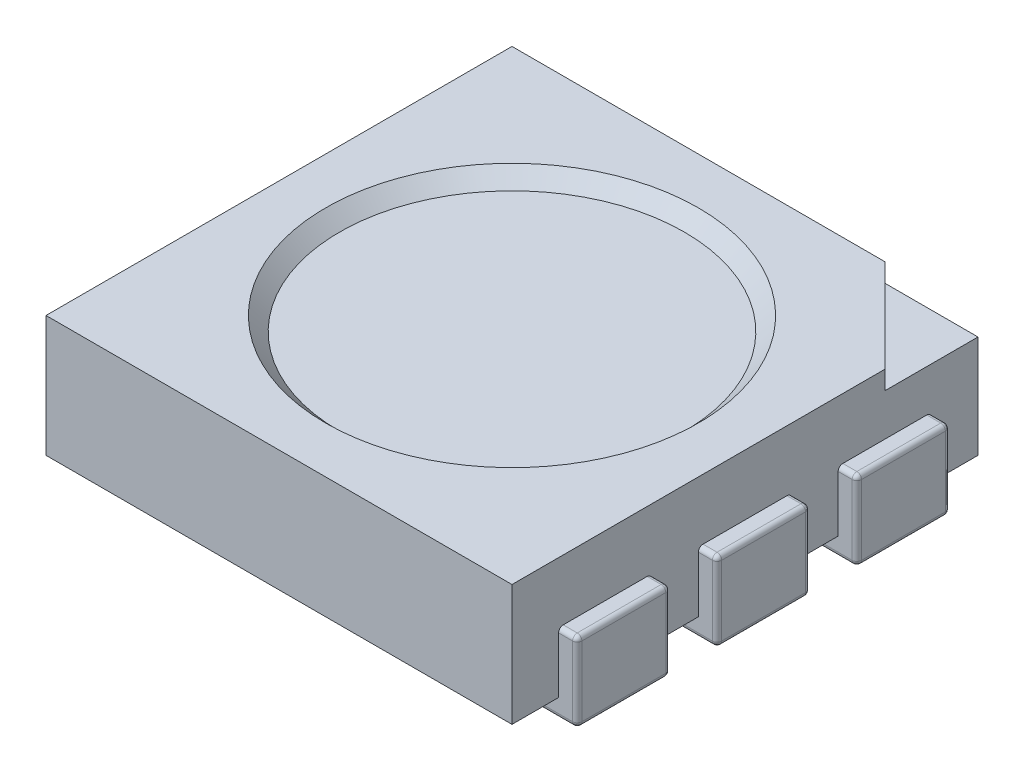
from build123d import *

# Parameters (mm, degrees)
SKETCH1_W                = 5
SKETCH1_H                = 5
BOSS_EXTRUDE1_DEPTH      = 1.3
CUT_EXTRUDE1_DEPTH       = 0.2
SKETCH3_R                = 2
CUT_EXTRUDE2_DEPTH       = 0.65
CUT_EXTRUDE2_DRAFT       = -45
BOSS_EXTRUDE2_DEPTH      = 0.2
BOSS_EXTRUDE2_DEPTH_BACK = 0.65
SKETCH4_W                = 1.4
SKETCH4_H                = 1
SKETCH5_R                = 0.5
SKETCH5_W                = 1
SKETCH5_H                = 1.5
CUT_EXTRUDE3_DEPTH       = 0.1
SKETCH6_R                = 0.25
CUT_EXTRUDE4_DEPTH       = 0.1
SKETCH7_R                = 1.35
BOSS_EXTRUDE3_DEPTH      = 0.5
BOSS_EXTRUDE3_DRAFT      = -45
FILLET2_R                = 0.05


with BuildPart() as part:
    # Sketch1 → Boss-Extrude1 (new body)
    with BuildSketch(Plane(origin=(0, 0, 0), x_dir=(1, 0, 0), z_dir=(0, 1, 0))):
        with Locations((2.5, 2.5)):
            Rectangle(SKETCH1_W, SKETCH1_H)
    extrude(amount=BOSS_EXTRUDE1_DEPTH)

    # Sketch2 → Cut-Extrude1 (cut)
    with BuildSketch(Plane(origin=(0, 1.3, 0), x_dir=(1, 0, 0), z_dir=(0, 1, 0))):
        Polygon((5, 5), (4, 5), (5, 4), align=None)
    extrude(amount=-CUT_EXTRUDE1_DEPTH, mode=Mode.SUBTRACT)


with BuildPart() as cut_extrude2_tool:
    # Sketch3 → Cut-Extrude2 (with draft: the straight prism first)
    with BuildSketch(Plane(origin=(0, 1.3, 0), x_dir=(1, 0, 0), z_dir=(0, 1, 0))):
        with Locations((2.5, 2.5)):
            Circle(SKETCH3_R)
    extrude(amount=-CUT_EXTRUDE2_DEPTH)
    # Cut-Extrude2: the draft: its side faces are tilted about the plane it starts from
    cut_extrude2_sides = [cut_extrude2_tool.faces().sort_by_distance(p)[0] for p in [
        (0.5, 0.975, -2.5),
    ]]
    draft(cut_extrude2_sides, Plane(origin=(0, 1.3, 0), x_dir=(1, 0, 0), z_dir=(0, 1, 0)), CUT_EXTRUDE2_DRAFT)


with BuildPart() as part_1:
    add(part.part)

    # Cut-Extrude2: cut by cut_extrude2_tool
    add(cut_extrude2_tool.part, mode=Mode.SUBTRACT)

    # Sketch4 → Boss-Extrude2 (add, two sides: drawn at the far end of the back side and taken through both)
    with BuildSketch(Plane.XZ.offset(-BOSS_EXTRUDE2_DEPTH_BACK)):
        with Locations((0.5, -2.5)):
            Rectangle(SKETCH4_W, SKETCH4_H)
        with Locations((0.5, -1)):
            Rectangle(SKETCH4_W, SKETCH4_H)
        with Locations((0.5, -4)):
            Rectangle(SKETCH4_W, SKETCH4_H)
        with Locations((4.5, -4)):
            Rectangle(SKETCH4_W, SKETCH4_H)
        with Locations((4.5, -2.5)):
            Rectangle(SKETCH4_W, SKETCH4_H)
        with Locations((4.5, -1)):
            Rectangle(SKETCH4_W, SKETCH4_H)
    extrude(amount=BOSS_EXTRUDE2_DEPTH + BOSS_EXTRUDE2_DEPTH_BACK)

    # Sketch5 → Cut-Extrude3 (cut)
    with BuildSketch(Plane.XZ):
        with Locations(Location((2.5, -2.5, 0), (0, 0, 270))):
            Circle(SKETCH5_R)
        with Locations((2.5, -3.85)):
            Rectangle(SKETCH5_W, SKETCH5_H)
        with Locations((2.5, -1.15)):
            Rectangle(SKETCH5_W, SKETCH5_H)
    extrude(amount=-CUT_EXTRUDE3_DEPTH, mode=Mode.SUBTRACT)

    # Sketch6 → Cut-Extrude4 (cut)
    with BuildSketch(Plane.XZ.offset(-0.1)):
        with Locations(Location((2.5, -2.5, 0), (0, 0, 270))):
            Circle(SKETCH6_R)
    extrude(amount=-CUT_EXTRUDE4_DEPTH, mode=Mode.SUBTRACT)


with BuildPart() as boss_extrude3_tool:
    # Sketch7 → Boss-Extrude3 (with draft: the straight prism first)
    with BuildSketch(Plane(origin=(0, 0.65, 0), x_dir=(1, 0, 0), z_dir=(0, 1, 0))):
        with Locations((2.5, 2.5)):
            Circle(SKETCH7_R)
    extrude(amount=BOSS_EXTRUDE3_DEPTH)
    # Boss-Extrude3: the draft: its side faces are tilted about the plane it starts from
    boss_extrude3_sides = [boss_extrude3_tool.faces().sort_by_distance(p)[0] for p in [
        (1.15, 0.9, -2.5),
    ]]
    draft(boss_extrude3_sides, Plane(origin=(0, 0.65, 0), x_dir=(1, 0, 0), z_dir=(0, 1, 0)), BOSS_EXTRUDE3_DRAFT)


with BuildPart() as part_2:
    add(part_1.part)

    # Boss-Extrude3: add boss_extrude3_tool
    add(boss_extrude3_tool.part)

    # Fillet2
    fillet2_edges = [part_2.edges().sort_by_distance(p)[0] for p in [
        (5.2, 0.225, -2),
        (5.1, 0.65, -2),
        (3.8, -0.1, -2),
        (5.1, 0.65, -3),
        (3.8, -0.1, -3),
        (5.2, 0.225, -3),
        (5.2, 0.65, -2.5),
        (4.5, -0.2, -2),
        (3.8, -0.2, -2.5),
        (4.5, -0.2, -3),
        (5.2, -0.2, -2.5),
        (5.2, 0.225, -0.5),
        (5.1, 0.65, -0.5),
        (3.8, -0.1, -0.5),
        (5.1, 0.65, -1.5),
        (3.8, -0.1, -1.5),
        (5.2, 0.225, -1.5),
        (5.2, 0.65, -1),
        (4.5, -0.2, -0.5),
        (3.8, -0.2, -1),
        (4.5, -0.2, -1.5),
        (5.2, -0.2, -1),
        (-0.1, 0.65, -1.5),
        (-0.2, 0.225, -1.5),
        (-0.1, 0.65, -0.5),
        (1.2, -0.1, -0.5),
        (-0.2, 0.225, -0.5),
        (-0.2, 0.65, -1),
        (1.2, -0.1, -1.5),
        (-0.2, -0.2, -1),
        (0.5, -0.2, -1.5),
        (1.2, -0.2, -1),
        (0.5, -0.2, -0.5),
        (-0.1, 0.65, -3),
        (-0.2, 0.225, -3),
        (-0.1, 0.65, -2),
        (1.2, -0.1, -2),
        (-0.2, 0.225, -2),
        (-0.2, 0.65, -2.5),
        (1.2, -0.1, -3),
        (-0.2, -0.2, -2.5),
        (0.5, -0.2, -3),
        (1.2, -0.2, -2.5),
        (0.5, -0.2, -2),
        (-0.1, 0.65, -4.5),
        (-0.2, 0.225, -4.5),
        (-0.1, 0.65, -3.5),
        (1.2, -0.1, -3.5),
        (-0.2, 0.225, -3.5),
        (-0.2, 0.65, -4),
        (1.2, -0.1, -4.5),
        (-0.2, -0.2, -4),
        (0.5, -0.2, -4.5),
        (1.2, -0.2, -4),
        (0.5, -0.2, -3.5),
        (5.2, 0.225, -3.5),
        (5.1, 0.65, -3.5),
        (3.8, -0.1, -3.5),
        (5.1, 0.65, -4.5),
        (3.8, -0.1, -4.5),
        (5.2, 0.225, -4.5),
        (5.2, 0.65, -4),
        (4.5, -0.2, -3.5),
        (3.8, -0.2, -4),
        (4.5, -0.2, -4.5),
        (5.2, -0.2, -4),
    ]]
    fillet(fillet2_edges, radius=FILLET2_R)


solid = part_2.part
